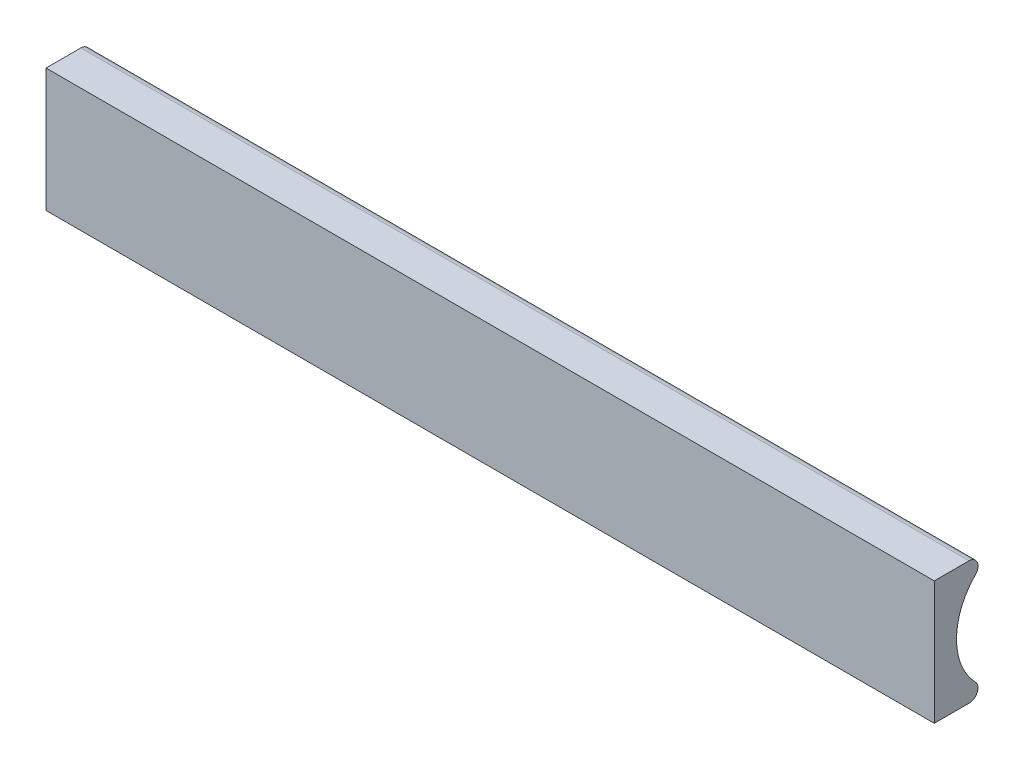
from build123d import *

# Parameters (mm, degrees)
SKETCH_1_W          = 20
SKETCH_1_H          = 2.7775
EXTRUDE_1_DEPTH     = 2
SKETCH_2_R          = 1.5
CUT_EXTRUDE_1_DEPTH = 21.1476705
FILLET_1_R          = 0.2


with BuildPart() as part:
    # Sketch 1 → Extrude 1 (new body)
    with BuildSketch(Plane.XY):
        with Locations((-4, 0)):
            Rectangle(SKETCH_1_W, SKETCH_1_H)
    extrude(amount=-EXTRUDE_1_DEPTH)

    # Sketch 2 → Cut-Extrude 1 (cut, through all)
    with BuildSketch(Plane.ZY.offset(14)):
        with Locations((-2, 0)):
            Circle(SKETCH_2_R)
    extrude(amount=-CUT_EXTRUDE_1_DEPTH, mode=Mode.SUBTRACT)

    # Fillet 1
    fillet_1_edges = [part.edges().sort_by_distance(p)[0] for p in [
        (-4, -1.38875, -1.433101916),
        (-4, 1.38875, -1.433101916),
    ]]
    fillet(fillet_1_edges, radius=FILLET_1_R)


solid = part.part
